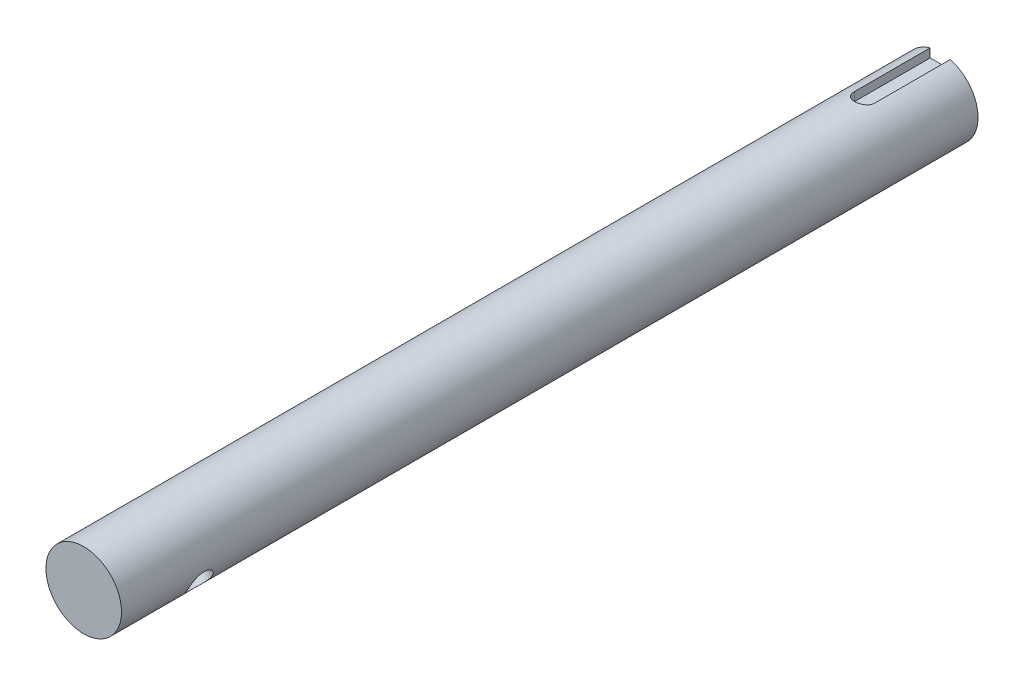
from build123d import *

# Parameters (mm, degrees)
ESQUISSE1_R                  = 15
BASE_EXTRUSION_DEPTH         = 340
ESQUISSE2_W                  = 30
ESQUISSE2_H                  = 4
ENL_V_MAT_EXTRU_1_DEPTH      = 4
ESQUISSE5_R                  = 4
ENL_V_MAT_EXTRU_2_DEPTH      = 342.322428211
M8X1_25_TROU_TARAUD_1_D      = 6.8
M8X1_25_TROU_TARAUD_1_DEPTH  = 26.25
M8X1_25_TROU_TARAUD_1_TIP    = 2.042926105
ENL_V_MAT_EXTRU_3_DEPTH      = 341.661122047
ENL_V_MAT_EXTRU_3_DEPTH_BACK = 341.661122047
ESQUISSE6_R                  = 5


with BuildPart() as part:
    # Esquisse1 → Base-Extrusion (new body)
    with BuildSketch(Plane.XY):
        with Locations(Location((0, 0, 0), (0, 0, 105.466009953))):
            Circle(ESQUISSE1_R)
    extrude(amount=BASE_EXTRUSION_DEPTH)

    # Esquisse2 → Enl_v. mat.-Extru.1 (cut, symmetric)
    with BuildSketch(Plane(origin=(0, 0, 0), x_dir=(0, 0, -1), z_dir=(1, 0, 0))):
        with Locations((-15, 13)):
            Rectangle(ESQUISSE2_W, ESQUISSE2_H)
    extrude(amount=ENL_V_MAT_EXTRU_1_DEPTH, both=True, mode=Mode.SUBTRACT)

    # Esquisse5 → Enl_v. mat.-Extru.2 (cut, through all)
    with BuildSketch(Plane(origin=(0, 11, 0), x_dir=(-1, 0, 0), z_dir=(0, 1, 0))):
        with Locations((0, 30)):
            Circle(ESQUISSE5_R)
    extrude(amount=ENL_V_MAT_EXTRU_2_DEPTH, mode=Mode.SUBTRACT)

    # M8x1.25 Trou taraud_1
    with Locations(Plane(origin=(0, 0, 0), x_dir=(-1, 0, 0), z_dir=(0, 0, -1))):
        with Locations((0, 0)):
            Hole(M8X1_25_TROU_TARAUD_1_D / 2, depth=M8X1_25_TROU_TARAUD_1_DEPTH)
            with Locations((0, 0, -(M8X1_25_TROU_TARAUD_1_DEPTH + M8X1_25_TROU_TARAUD_1_TIP / 2))):  # 118° drill point
                Cone(0, M8X1_25_TROU_TARAUD_1_D / 2, M8X1_25_TROU_TARAUD_1_TIP, mode=Mode.SUBTRACT)

    # Esquisse6 → Enl_v. mat.-Extru.3 (cut, two sides: drawn at the far end of the back side and taken through both)
    with BuildSketch(Plane(origin=(0, 0, 0), x_dir=(0, 0, -1), z_dir=(0.8660254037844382, -0.500000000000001, 0)).offset(-ENL_V_MAT_EXTRU_3_DEPTH_BACK)):
        with Locations(Location((-307, 0, 0), (0, 0, 90))):
            Circle(ESQUISSE6_R)
    extrude(amount=ENL_V_MAT_EXTRU_3_DEPTH + ENL_V_MAT_EXTRU_3_DEPTH_BACK, mode=Mode.SUBTRACT)


solid = part.part
